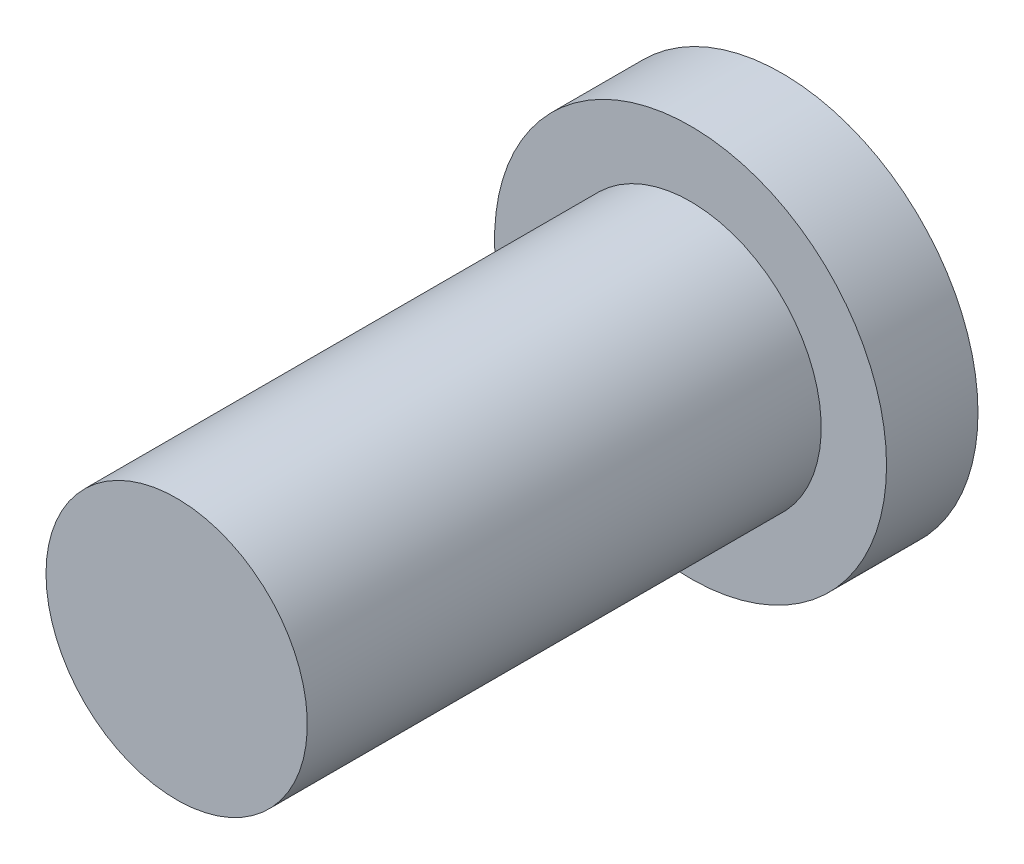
from build123d import *

# Parameters (mm, degrees)
SKETCH1_R           = 1.143
BASE_EXTRUDE_DEPTH  = 0.5334
SKETCH2_R           = 0.762
BOSS_EXTRUDE1_DEPTH = 2.9972
CUT_EXTRUDE1_DEPTH  = 0.381


with BuildPart() as part:
    # Sketch1 → Base-Extrude (new body)
    with BuildSketch(Plane.XY):
        Circle(SKETCH1_R)
    extrude(amount=BASE_EXTRUDE_DEPTH)

    # Sketch2 → Boss-Extrude1 (add)
    with BuildSketch(Plane.XY.offset(0.5334)):
        with Locations(Location((0, 0, 0), (0, 0, 180))):
            Circle(SKETCH2_R)
    extrude(amount=BOSS_EXTRUDE1_DEPTH)

    # Sketch3 → Cut-Extrude1 (cut)
    with BuildSketch(Plane(origin=(0, 0, 0), x_dir=(-1, 0, 0), z_dir=(0, 0, -1))):
        Polygon((0.1905, -0.1905), (0.5715, -0.1905), (0.5715, 0.1905), (0.1905, 0.1905), (0.1905, 0.5715), (-0.1905, 0.5715), (-0.1905, 0.1905), (-0.5715, 0.1905), (-0.5715, -0.1905), (-0.1905, -0.1905), (-0.1905, -0.5715), (0.1905, -0.5715), align=None)
    extrude(amount=-CUT_EXTRUDE1_DEPTH, mode=Mode.SUBTRACT)


solid = part.part
